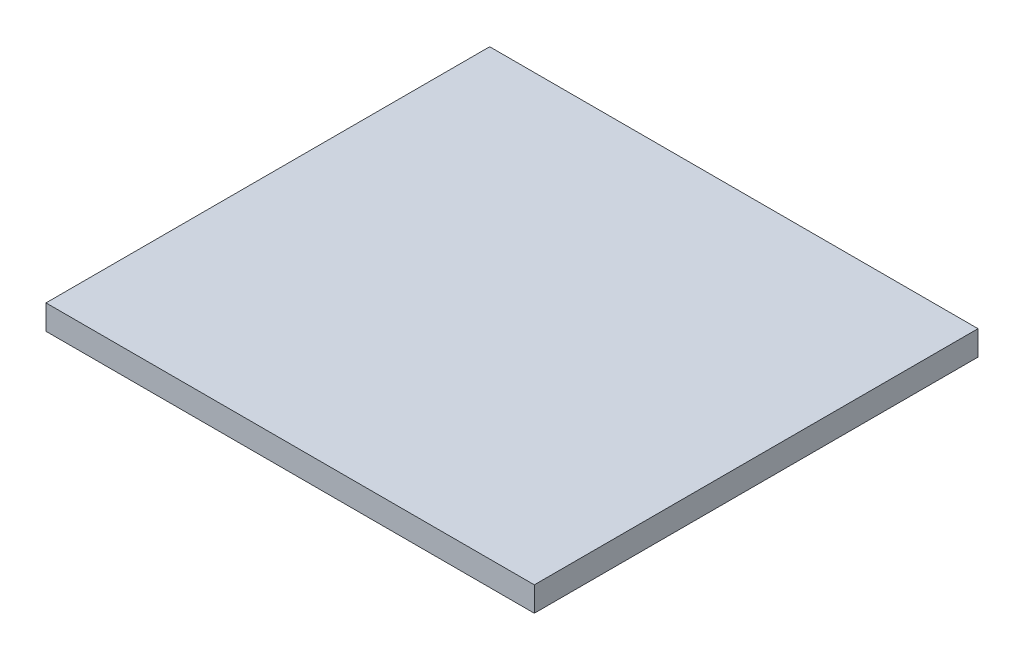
from build123d import *

# Parameters (mm, degrees)
SKETCH3_W           = 99.089895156
SKETCH3_H           = 90.028443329
BOSS_EXTRUDE1_DEPTH = 5


with BuildPart() as part:
    # Sketch3 → Boss-Extrude1 (new body)
    with BuildSketch(Plane(origin=(0, 0, 0), x_dir=(1, 0, 0), z_dir=(0, 1, 0))):
        with Locations((0, 0.583749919)):
            Rectangle(SKETCH3_W, SKETCH3_H)
    extrude(amount=BOSS_EXTRUDE1_DEPTH)


solid = part.part
